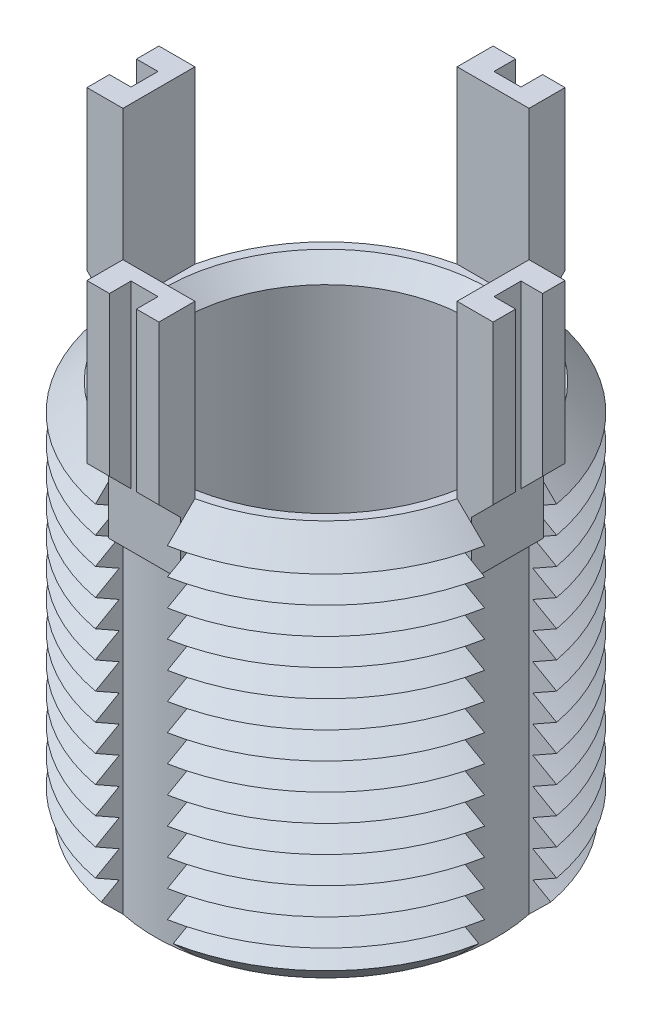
from build123d import *

# Parameters (mm, degrees)
SKETCH1_R               = 11
BOSS_EXTRUDE1_DEPTH     = 22
CHAMFER1_SIZE           = 1.5
LPATTERN1_COUNT         = 13
LPATTERN1_PITCH         = 1.5
CUT_EXTRUDE1_REACH      = 28.944
CIRPATTERN1_COUNT       = 4
BOSS_EXTRUDE3_DEPTH     = 2
CIRPATTERN2_COUNT       = 4
CUT_EXTRUDE3_DEPTH      = 36.313548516
CUT_EXTRUDE3_DEPTH_BACK = 36.313548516
SKETCH6_W               = 1.2
SKETCH6_H               = 1.5
SKETCH6_W_2             = 1.5
SKETCH6_H_2             = 1.2
SKETCH7_R               = 8
CUT_EXTRUDE4_DEPTH      = 22
CHAMFER2_SIZE           = 1


with BuildPart() as part:
    # Sketch1 → Boss-Extrude1 (new body)
    with BuildSketch(Plane(origin=(0, 0, 0), x_dir=(1, 0, 0), z_dir=(0, 1, 0))):
        with Locations(Location((0, 0, 0), (0, 0, 270))):
            Circle(SKETCH1_R)
    extrude(amount=-BOSS_EXTRUDE1_DEPTH)

    # Chamfer1
    chamfer1_edges = [part.edges().sort_by_distance(p)[0] for p in [
        (0, 0, -11),
        (0, -22, -11),
    ]]
    chamfer(chamfer1_edges, length=CHAMFER1_SIZE)

    # Sketch3 → Cut-Revolve1 (revolve, cut)
    with BuildSketch(Plane(origin=(0, 0, 0), x_dir=(0, 0, -1), z_dir=(1, 0, 0))):
        Polygon((-11, -1.5), (-9.700961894, -2.25), (-11, -3), align=None)
    cut_revolve1 = revolve(axis=Axis((0, 0.885892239, 0), (0, -1, 0)), mode=Mode.SUBTRACT)

    # LPattern1: Cut-Revolve1 ×13
    with Locations(*[(0, -i * LPATTERN1_PITCH, 0) for i in range(1, LPATTERN1_COUNT)]):
        add(cut_revolve1, mode=Mode.SUBTRACT)

    # Cut-Extrude1: up to this cone (the profile starts inside it)
    cut_extrude1_end = Plane(origin=(0, 0, 0), z_dir=(0, 1, 0)).offset(-31.499999) * Cone(1e-06, 92.444, 92.443999, align=(Align.CENTER, Align.CENTER, Align.MIN), mode=Mode.PRIVATE)
    # Sketch4 → Cut-Extrude1 (cut, up to the surface)
    with BuildSketch(Plane(origin=(0, 0, 0), x_dir=(1, 0, 0), z_dir=(0, 1, 0)), mode=Mode.PRIVATE) as cut_extrude1_sk1:
        with BuildLine():
            Line((-9.287087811, 2), (-10.816653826, 2))
            ThreePointArc((-10.816653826, 2), (-11, 0), (-10.816653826, -2))
            Line((-10.816653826, -2), (-9.287087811, -2))
            ThreePointArc((-9.287087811, -2), (-9.5, 0), (-9.287087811, 2))
        make_face()
    cut_extrude1_tool1 = extrude(cut_extrude1_sk1.sketch, amount=-CUT_EXTRUDE1_REACH, mode=Mode.PRIVATE) & cut_extrude1_end
    cut_extrude1 = cut_extrude1_tool1.solids().sort_by_distance((-10.183877, 0, 0))[0]
    add(cut_extrude1, mode=Mode.SUBTRACT)

    # CirPattern1: Cut-Extrude1 ×4 about axis
    cirpattern1_axis = Axis((0, 0, 0), (0, 1, 0))
    for i in range(1, CIRPATTERN1_COUNT):
        add(cut_extrude1.rotate(cirpattern1_axis, i * 360 / CIRPATTERN1_COUNT), mode=Mode.SUBTRACT)

    # Sketch5 → Boss-Extrude3 (add, symmetric)
    with BuildSketch(Plane(origin=(0, 0, 0), x_dir=(0, 0, -1), z_dir=(1, 0, 0))):
        Polygon((-9.287087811, 9.5), (-9.287087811, -3.5), (-10.087087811, -3.5), (-10.087087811, -0.5), (-11.287087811, 0.7), (-11.287087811, 9.5), align=None)
    boss_extrude3 = extrude(amount=BOSS_EXTRUDE3_DEPTH, both=True)

    # CirPattern2: Boss-Extrude3 ×4 about axis
    cirpattern2_axis = Axis((0, 0, 0), (0, 1, 0))
    for i in range(1, CIRPATTERN2_COUNT):
        add(boss_extrude3.rotate(cirpattern2_axis, i * 360 / CIRPATTERN2_COUNT))

    # Sketch6 → Cut-Extrude3 (cut, two sides: drawn at the far end of the back side and taken through both)
    with BuildSketch(Plane(origin=(0, 9.5, 0), x_dir=(1, 0, 0), z_dir=(0, 1, 0)).offset(-CUT_EXTRUDE3_DEPTH_BACK)):
        with Locations((-10.687087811, 0)):
            Rectangle(SKETCH6_W, SKETCH6_H)
        with Locations((0, 10.687087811)):
            Rectangle(SKETCH6_W_2, SKETCH6_H_2)
        with Locations((10.687087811, 0)):
            Rectangle(SKETCH6_W, SKETCH6_H)
        with Locations((0, -10.687087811)):
            Rectangle(SKETCH6_W_2, SKETCH6_H_2)
    extrude(amount=CUT_EXTRUDE3_DEPTH + CUT_EXTRUDE3_DEPTH_BACK, mode=Mode.SUBTRACT)

    # Sketch7 → Cut-Extrude4 (cut)
    with BuildSketch(Plane(origin=(0, 0, 0), x_dir=(1, 0, 0), z_dir=(0, 1, 0))):
        with Locations(Location((0, 0, 0), (0, 0, 270))):
            Circle(SKETCH7_R)
    extrude(amount=-CUT_EXTRUDE4_DEPTH, mode=Mode.SUBTRACT)

    # Chamfer2
    chamfer2_edges = [part.edges().sort_by_distance(p)[0] for p in [
        (0, 0, -8),
        (0, -22, -8),
    ]]
    chamfer(chamfer2_edges, length=CHAMFER2_SIZE)


solid = part.part
